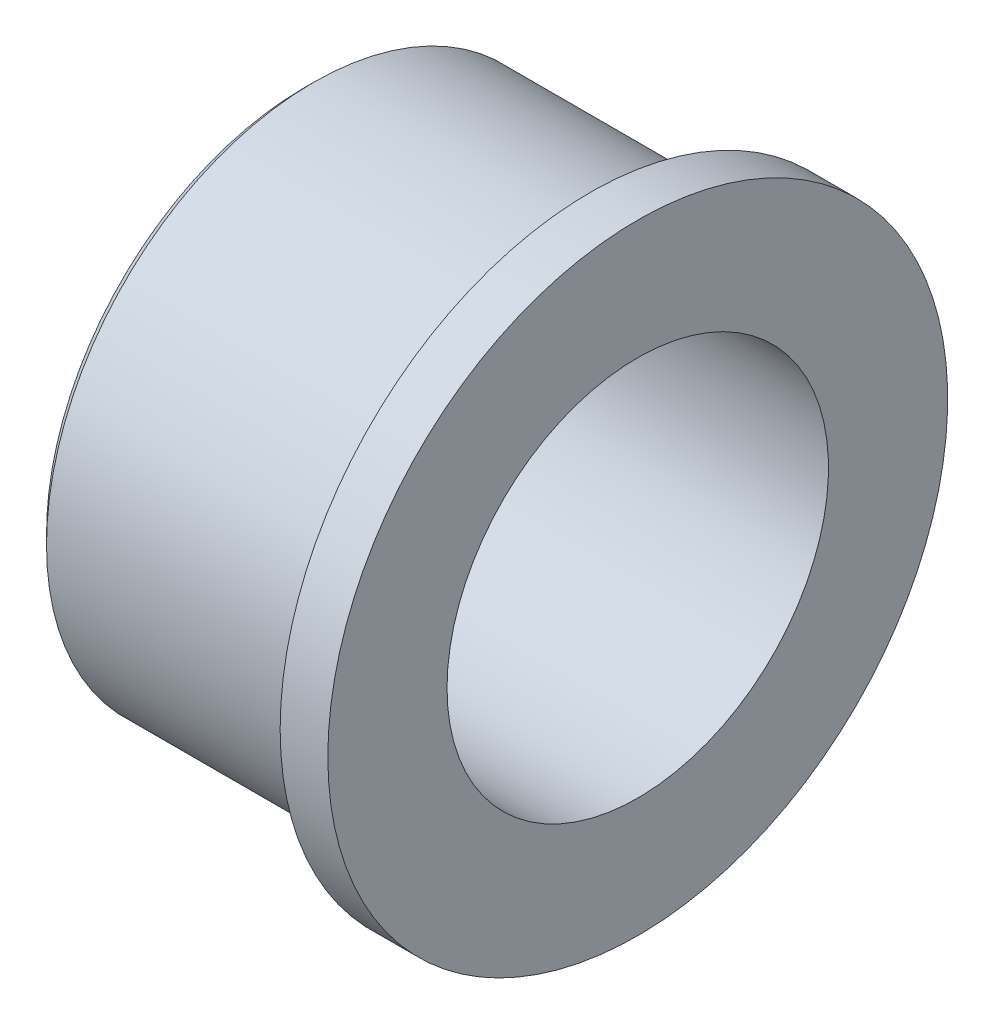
ISO-10303-21;
HEADER;
FILE_DESCRIPTION(('STEP AP214'),'2;1');
FILE_NAME('part.step','',(''),(''),'','','');
FILE_SCHEMA(('AUTOMOTIVE_DESIGN { 1 0 10303 214 1 1 1 1 }'));
ENDSEC;
DATA;
#1=APPLICATION_CONTEXT('core data for automotive mechanical design processes');
#2=APPLICATION_PROTOCOL_DEFINITION('international standard','automotive_design',2000,#1);
#3=PRODUCT_CONTEXT('',#1,'mechanical');
#4=PRODUCT('Part','Part','',(#3));
#5=PRODUCT_RELATED_PRODUCT_CATEGORY('part','',(#4));
#6=PRODUCT_DEFINITION_FORMATION('','',#4);
#7=PRODUCT_DEFINITION_CONTEXT('part definition',#1,'design');
#8=PRODUCT_DEFINITION('design','',#6,#7);
#9=PRODUCT_DEFINITION_SHAPE('','',#8);
#10=(LENGTH_UNIT() NAMED_UNIT(*) SI_UNIT(.MILLI.,.METRE.));
#11=(NAMED_UNIT(*) PLANE_ANGLE_UNIT() SI_UNIT($,.RADIAN.));
#12=(NAMED_UNIT(*) SI_UNIT($,.STERADIAN.) SOLID_ANGLE_UNIT());
#13=UNCERTAINTY_MEASURE_WITH_UNIT(LENGTH_MEASURE(1.E-05),#10,'distance_accuracy_value','');
#14=(GEOMETRIC_REPRESENTATION_CONTEXT(3) GLOBAL_UNCERTAINTY_ASSIGNED_CONTEXT((#13)) GLOBAL_UNIT_ASSIGNED_CONTEXT((#10,
#11,#12)) REPRESENTATION_CONTEXT('',''));
#15=CARTESIAN_POINT('',(0.,0.,0.));
#16=DIRECTION('',(0.,0.,1.));
#17=DIRECTION('',(1.,0.,0.));
#18=AXIS2_PLACEMENT_3D('',#15,#16,#17);
#19=CARTESIAN_POINT('',(0.,0.,0.));
#20=DIRECTION('',(-1.,0.,0.));
#21=DIRECTION('',(0.,0.,1.));
#22=AXIS2_PLACEMENT_3D('',#19,#20,#21);
#23=CYLINDRICAL_SURFACE('',#22,2.);
#24=CARTESIAN_POINT('',(0.0999999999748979,0.,0.));
#25=DIRECTION('',(-1.,0.,0.));
#26=DIRECTION('',(0.,0.,1.));
#27=AXIS2_PLACEMENT_3D('',#24,#25,#26);
#28=CIRCLE('',#27,1.99999999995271);
#29=CARTESIAN_POINT('',(0.0999999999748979,0.,1.99999999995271));
#30=VERTEX_POINT('',#29);
#31=EDGE_CURVE('E30',#30,#30,#28,.T.);
#32=ORIENTED_EDGE('',*,*,#31,.T.);
#33=EDGE_LOOP('',(#32));
#34=FACE_BOUND('',#33,.T.);
#35=CARTESIAN_POINT('',(3.5,0.,0.));
#36=DIRECTION('',(-1.,0.,0.));
#37=DIRECTION('',(0.,0.,1.));
#38=AXIS2_PLACEMENT_3D('',#35,#36,#37);
#39=CIRCLE('',#38,2.);
#40=CARTESIAN_POINT('',(3.5,0.,2.));
#41=VERTEX_POINT('',#40);
#42=EDGE_CURVE('E18',#41,#41,#39,.F.);
#43=ORIENTED_EDGE('',*,*,#42,.T.);
#44=EDGE_LOOP('',(#43));
#45=FACE_BOUND('',#44,.T.);
#46=ADVANCED_FACE('F15',(#34,#45),#23,.F.);
#47=CARTESIAN_POINT('',(3.5,2.,0.));
#48=DIRECTION('',(-1.,0.,0.));
#49=DIRECTION('',(0.,0.,1.));
#50=AXIS2_PLACEMENT_3D('',#47,#48,#49);
#51=PLANE('',#50);
#52=ORIENTED_EDGE('',*,*,#42,.F.);
#53=EDGE_LOOP('',(#52));
#54=FACE_BOUND('',#53,.T.);
#55=CARTESIAN_POINT('',(3.5,0.,0.));
#56=DIRECTION('',(-1.,0.,0.));
#57=DIRECTION('',(0.,0.,1.));
#58=AXIS2_PLACEMENT_3D('',#55,#56,#57);
#59=CIRCLE('',#58,3.25);
#60=CARTESIAN_POINT('',(3.5,0.,3.25));
#61=VERTEX_POINT('',#60);
#62=EDGE_CURVE('E32',#61,#61,#59,.T.);
#63=ORIENTED_EDGE('',*,*,#62,.F.);
#64=EDGE_LOOP('',(#63));
#65=FACE_BOUND('',#64,.T.);
#66=ADVANCED_FACE('F46',(#54,#65),#51,.F.);
#67=CARTESIAN_POINT('',(-5.6843418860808E-11,0.,0.));
#68=DIRECTION('',(-1.,0.,0.));
#69=DIRECTION('',(0.,0.,1.));
#70=AXIS2_PLACEMENT_3D('',#67,#68,#69);
#71=CONICAL_SURFACE('',#70,2.09999999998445,0.785398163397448);
#72=CARTESIAN_POINT('',(-5.6843418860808E-11,0.,0.));
#73=DIRECTION('',(-1.,0.,0.));
#74=DIRECTION('',(0.,0.,1.));
#75=AXIS2_PLACEMENT_3D('',#72,#73,#74);
#76=CIRCLE('',#75,2.09999999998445);
#77=CARTESIAN_POINT('',(-5.6843418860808E-11,0.,2.09999999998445));
#78=VERTEX_POINT('',#77);
#79=EDGE_CURVE('E39',#78,#78,#76,.T.);
#80=ORIENTED_EDGE('',*,*,#79,.T.);
#81=EDGE_LOOP('',(#80));
#82=FACE_BOUND('',#81,.T.);
#83=ORIENTED_EDGE('',*,*,#31,.F.);
#84=EDGE_LOOP('',(#83));
#85=FACE_BOUND('',#84,.T.);
#86=ADVANCED_FACE('F48',(#82,#85),#71,.F.);
#87=CARTESIAN_POINT('',(0.,0.,0.));
#88=DIRECTION('',(-1.,0.,0.));
#89=DIRECTION('',(0.,0.,1.));
#90=AXIS2_PLACEMENT_3D('',#87,#88,#89);
#91=CYLINDRICAL_SURFACE('',#90,3.25);
#92=CARTESIAN_POINT('',(3.,0.,0.));
#93=DIRECTION('',(-1.,0.,0.));
#94=DIRECTION('',(0.,0.,1.));
#95=AXIS2_PLACEMENT_3D('',#92,#93,#94);
#96=CIRCLE('',#95,3.25);
#97=CARTESIAN_POINT('',(3.,0.,3.25));
#98=VERTEX_POINT('',#97);
#99=EDGE_CURVE('E36',#98,#98,#96,.F.);
#100=ORIENTED_EDGE('',*,*,#99,.T.);
#101=EDGE_LOOP('',(#100));
#102=FACE_BOUND('',#101,.T.);
#103=ORIENTED_EDGE('',*,*,#62,.T.);
#104=EDGE_LOOP('',(#103));
#105=FACE_BOUND('',#104,.T.);
#106=ADVANCED_FACE('F44',(#102,#105),#91,.T.);
#107=CARTESIAN_POINT('',(0.,2.8,0.));
#108=DIRECTION('',(1.,0.,0.));
#109=DIRECTION('',(0.,0.,-1.));
#110=AXIS2_PLACEMENT_3D('',#107,#108,#109);
#111=PLANE('',#110);
#112=ORIENTED_EDGE('',*,*,#79,.F.);
#113=EDGE_LOOP('',(#112));
#114=FACE_BOUND('',#113,.T.);
#115=CARTESIAN_POINT('',(-5.6843418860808E-11,0.,0.));
#116=DIRECTION('',(1.,0.,0.));
#117=DIRECTION('',(0.,1.,0.));
#118=AXIS2_PLACEMENT_3D('',#115,#116,#117);
#119=CIRCLE('',#118,2.70000000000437);
#120=CARTESIAN_POINT('',(-5.68434253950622E-11,2.70000000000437,0.));
#121=VERTEX_POINT('',#120);
#122=EDGE_CURVE('E27',#121,#121,#119,.T.);
#123=ORIENTED_EDGE('',*,*,#122,.F.);
#124=EDGE_LOOP('',(#123));
#125=FACE_BOUND('',#124,.T.);
#126=ADVANCED_FACE('F73',(#114,#125),#111,.F.);
#127=CARTESIAN_POINT('',(3.,3.25,0.));
#128=DIRECTION('',(1.,0.,0.));
#129=DIRECTION('',(0.,0.,-1.));
#130=AXIS2_PLACEMENT_3D('',#127,#128,#129);
#131=PLANE('',#130);
#132=ORIENTED_EDGE('',*,*,#99,.F.);
#133=EDGE_LOOP('',(#132));
#134=FACE_BOUND('',#133,.T.);
#135=CARTESIAN_POINT('',(3.,0.,0.));
#136=DIRECTION('',(-1.,0.,0.));
#137=DIRECTION('',(0.,0.,1.));
#138=AXIS2_PLACEMENT_3D('',#135,#136,#137);
#139=CIRCLE('',#138,2.8);
#140=CARTESIAN_POINT('',(3.,0.,2.8));
#141=VERTEX_POINT('',#140);
#142=EDGE_CURVE('E22',#141,#141,#139,.T.);
#143=ORIENTED_EDGE('',*,*,#142,.F.);
#144=EDGE_LOOP('',(#143));
#145=FACE_BOUND('',#144,.T.);
#146=ADVANCED_FACE('F66',(#134,#145),#131,.F.);
#147=CARTESIAN_POINT('',(0.0999999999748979,0.,0.));
#148=DIRECTION('',(1.,0.,0.));
#149=DIRECTION('',(0.,1.,0.));
#150=AXIS2_PLACEMENT_3D('',#147,#148,#149);
#151=CONICAL_SURFACE('',#150,2.80000000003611,0.785398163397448);
#152=CARTESIAN_POINT('',(0.100000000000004,0.,0.));
#153=DIRECTION('',(-1.,0.,0.));
#154=DIRECTION('',(0.,0.,1.));
#155=AXIS2_PLACEMENT_3D('',#152,#153,#154);
#156=CIRCLE('',#155,2.8);
#157=CARTESIAN_POINT('',(0.100000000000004,0.,2.8));
#158=VERTEX_POINT('',#157);
#159=EDGE_CURVE('E10',#158,#158,#156,.F.);
#160=ORIENTED_EDGE('',*,*,#159,.F.);
#161=EDGE_LOOP('',(#160));
#162=FACE_BOUND('',#161,.T.);
#163=ORIENTED_EDGE('',*,*,#122,.T.);
#164=EDGE_LOOP('',(#163));
#165=FACE_BOUND('',#164,.T.);
#166=ADVANCED_FACE('F61',(#162,#165),#151,.T.);
#167=CARTESIAN_POINT('',(0.,0.,0.));
#168=DIRECTION('',(-1.,0.,0.));
#169=DIRECTION('',(0.,0.,1.));
#170=AXIS2_PLACEMENT_3D('',#167,#168,#169);
#171=CYLINDRICAL_SURFACE('',#170,2.8);
#172=ORIENTED_EDGE('',*,*,#159,.T.);
#173=EDGE_LOOP('',(#172));
#174=FACE_BOUND('',#173,.T.);
#175=ORIENTED_EDGE('',*,*,#142,.T.);
#176=EDGE_LOOP('',(#175));
#177=FACE_BOUND('',#176,.T.);
#178=ADVANCED_FACE('F59',(#174,#177),#171,.T.);
#179=CLOSED_SHELL('',(#46,#66,#86,#106,#126,#146,#166,#178));
#180=MANIFOLD_SOLID_BREP('B1',#179);
#181=ADVANCED_BREP_SHAPE_REPRESENTATION('',(#18,#180),#14);
#182=SHAPE_DEFINITION_REPRESENTATION(#9,#181);
ENDSEC;
END-ISO-10303-21;
